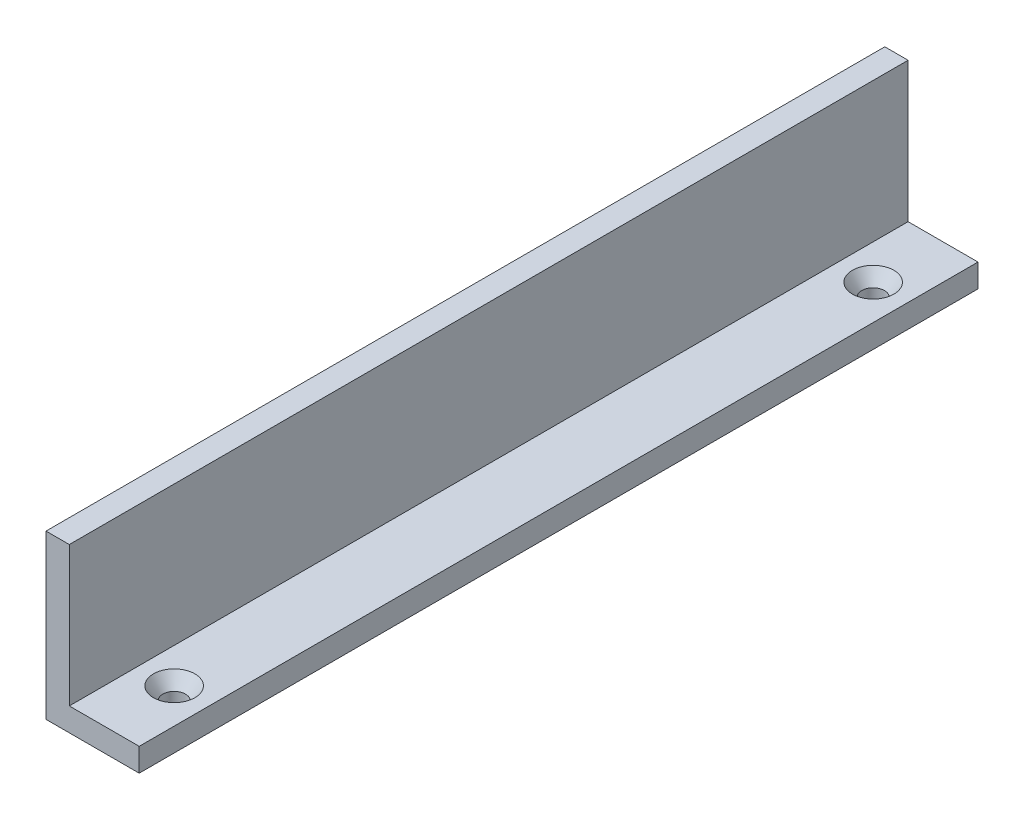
from build123d import *

# Parameters (mm, degrees)
BOSS_EXTRUDE1_DEPTH = 114.3


with BuildPart() as part:
    # Sketch1 → Boss-Extrude1 (new body)
    with BuildSketch(Plane.XY):
        Polygon((0, 0), (0, -22.225), (12.7, -22.225), (12.7, -19.05), (3.175, -19.05), (3.175, 0), align=None)
    extrude(amount=BOSS_EXTRUDE1_DEPTH)

    # Sketch2 → Cut-Revolve1 (revolve, cut)
    with BuildSketch(Plane.XY.offset(104.775), mode=Mode.PRIVATE) as cut_revolve1_sk:
        Polygon((6.394455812, -20.801456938), (5.1157872, -19.05), (7.254948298, -19.05), (7.9375, -19.05), (7.9375, -19.995771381), (7.9375, -30.379596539), (6.394455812, -24.265990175), align=None)
    cut_revolve1 = revolve(cut_revolve1_sk.sketch.rotate(Axis((7.9375, -19.995771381, 104.775), (0, -1, 0)), 270), axis=Axis((7.9375, -19.995771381, 104.775), (0, -1, 0)), mode=Mode.SUBTRACT)

    # Mirror1: Cut-Revolve1 across plane
    add(cut_revolve1.mirror(Plane.XY.offset(57.15)), mode=Mode.SUBTRACT)


solid = part.part
